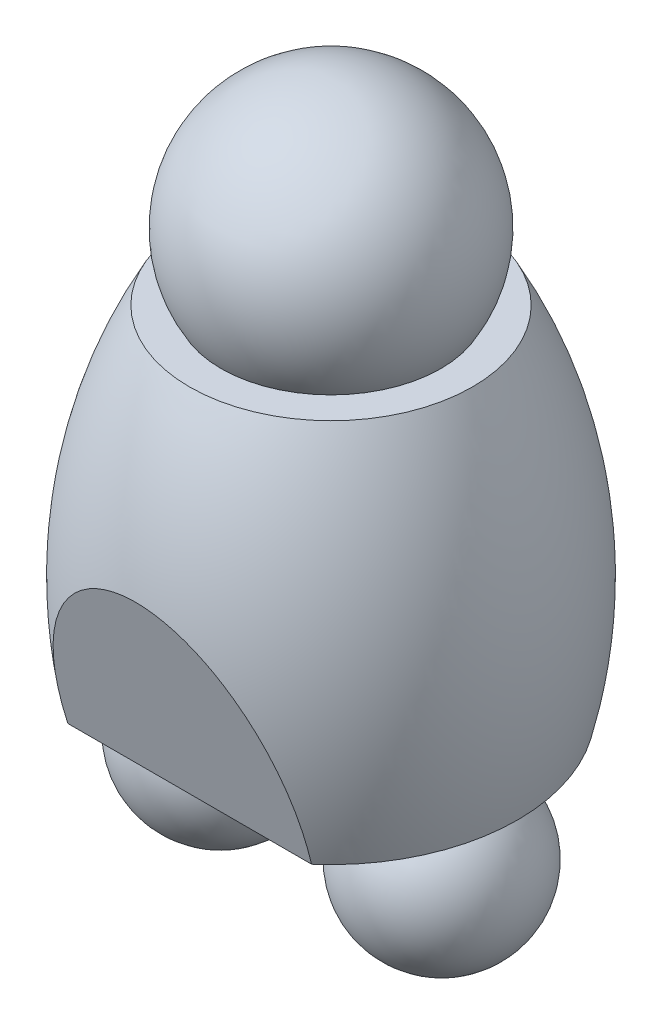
ISO-10303-21;
HEADER;
FILE_DESCRIPTION(('STEP AP214'),'2;1');
FILE_NAME('part.step','',(''),(''),'','','');
FILE_SCHEMA(('AUTOMOTIVE_DESIGN { 1 0 10303 214 1 1 1 1 }'));
ENDSEC;
DATA;
#1=APPLICATION_CONTEXT('core data for automotive mechanical design processes');
#2=APPLICATION_PROTOCOL_DEFINITION('international standard','automotive_design',2000,#1);
#3=PRODUCT_CONTEXT('',#1,'mechanical');
#4=PRODUCT('Part','Part','',(#3));
#5=PRODUCT_RELATED_PRODUCT_CATEGORY('part','',(#4));
#6=PRODUCT_DEFINITION_FORMATION('','',#4);
#7=PRODUCT_DEFINITION_CONTEXT('part definition',#1,'design');
#8=PRODUCT_DEFINITION('design','',#6,#7);
#9=PRODUCT_DEFINITION_SHAPE('','',#8);
#10=(LENGTH_UNIT() NAMED_UNIT(*) SI_UNIT(.MILLI.,.METRE.));
#11=(NAMED_UNIT(*) PLANE_ANGLE_UNIT() SI_UNIT($,.RADIAN.));
#12=(NAMED_UNIT(*) SI_UNIT($,.STERADIAN.) SOLID_ANGLE_UNIT());
#13=UNCERTAINTY_MEASURE_WITH_UNIT(LENGTH_MEASURE(1.E-05),#10,'distance_accuracy_value','');
#14=(GEOMETRIC_REPRESENTATION_CONTEXT(3) GLOBAL_UNCERTAINTY_ASSIGNED_CONTEXT((#13)) GLOBAL_UNIT_ASSIGNED_CONTEXT((#10,
#11,#12)) REPRESENTATION_CONTEXT('',''));
#15=CARTESIAN_POINT('',(0.,0.,0.));
#16=DIRECTION('',(0.,0.,1.));
#17=DIRECTION('',(1.,0.,0.));
#18=AXIS2_PLACEMENT_3D('',#15,#16,#17);
#19=CARTESIAN_POINT('',(-0.000695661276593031,100.35997198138,0.571810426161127));
#20=DIRECTION('',(0.,-1.,0.));
#21=DIRECTION('',(0.,0.,-1.));
#22=AXIS2_PLACEMENT_3D('',#19,#20,#21);
#23=PLANE('',#22);
#24=CARTESIAN_POINT('',(-0.000695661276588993,100.35997198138,0.571810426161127));
#25=DIRECTION('',(0.,-1.,0.));
#26=DIRECTION('',(0.,0.,-1.));
#27=AXIS2_PLACEMENT_3D('',#24,#25,#26);
#28=CIRCLE('',#27,65.0874690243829);
#29=CARTESIAN_POINT('',(-0.000695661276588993,100.35997198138,-64.5156585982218));
#30=VERTEX_POINT('',#29);
#31=EDGE_CURVE('E68',#30,#30,#28,.T.);
#32=ORIENTED_EDGE('',*,*,#31,.T.);
#33=EDGE_LOOP('',(#32));
#34=FACE_BOUND('',#33,.T.);
#35=CARTESIAN_POINT('',(-0.000695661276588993,100.35997198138,0.571810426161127));
#36=DIRECTION('',(0.,1.,0.));
#37=DIRECTION('',(0.,0.,1.));
#38=AXIS2_PLACEMENT_3D('',#35,#36,#37);
#39=CIRCLE('',#38,83.8200000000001);
#40=CARTESIAN_POINT('',(-0.000695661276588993,100.35997198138,84.3918104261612));
#41=VERTEX_POINT('',#40);
#42=EDGE_CURVE('E74',#41,#41,#39,.T.);
#43=ORIENTED_EDGE('',*,*,#42,.T.);
#44=EDGE_LOOP('',(#43));
#45=FACE_BOUND('',#44,.T.);
#46=ADVANCED_FACE('F32',(#34,#45),#23,.F.);
#47=CARTESIAN_POINT('',(-0.000695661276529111,-108.42802801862,0.571810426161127));
#48=DIRECTION('',(0.,1.,0.));
#49=DIRECTION('',(0.,0.,1.));
#50=AXIS2_PLACEMENT_3D('',#47,#48,#49);
#51=PLANE('',#50);
#52=CARTESIAN_POINT('',(-65.5326956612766,-108.42802801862,0.571810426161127));
#53=DIRECTION('',(0.,1.,0.));
#54=DIRECTION('',(0.,0.,1.));
#55=AXIS2_PLACEMENT_3D('',#52,#53,#54);
#56=CIRCLE('',#55,25.4448675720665);
#57=CARTESIAN_POINT('',(-65.5326956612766,-108.42802801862,26.0166779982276));
#58=VERTEX_POINT('',#57);
#59=EDGE_CURVE('E35',#58,#58,#56,.T.);
#60=ORIENTED_EDGE('',*,*,#59,.T.);
#61=EDGE_LOOP('',(#60));
#62=FACE_BOUND('',#61,.T.);
#63=CARTESIAN_POINT('',(65.5313043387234,-108.42802801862,0.571810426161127));
#64=DIRECTION('',(0.,1.,0.));
#65=DIRECTION('',(0.,0.,1.));
#66=AXIS2_PLACEMENT_3D('',#63,#64,#65);
#67=CIRCLE('',#66,25.4448675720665);
#68=CARTESIAN_POINT('',(65.5313043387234,-108.42802801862,26.0166779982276));
#69=VERTEX_POINT('',#68);
#70=EDGE_CURVE('E164',#69,#69,#67,.T.);
#71=ORIENTED_EDGE('',*,*,#70,.T.);
#72=EDGE_LOOP('',(#71));
#73=FACE_BOUND('',#72,.T.);
#74=CARTESIAN_POINT('',(-0.000695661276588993,-108.42802801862,0.571810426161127));
#75=DIRECTION('',(0.,1.,0.));
#76=DIRECTION('',(0.,0.,1.));
#77=AXIS2_PLACEMENT_3D('',#74,#75,#76);
#78=CIRCLE('',#77,110.49);
#79=CARTESIAN_POINT('',(72.1683763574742,-108.42802801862,84.2358119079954));
#80=VERTEX_POINT('',#79);
#81=CARTESIAN_POINT('',(71.1075015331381,-108.42802801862,-83.9957033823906));
#82=VERTEX_POINT('',#81);
#83=EDGE_CURVE('E67',#80,#82,#78,.T.);
#84=ORIENTED_EDGE('',*,*,#83,.F.);
#85=DIRECTION('',(1.,0.,0.));
#86=VECTOR('',#85,1.);
#87=CARTESIAN_POINT('',(-95.8619077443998,-108.42802801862,84.2358119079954));
#88=LINE('',#87,#86);
#89=CARTESIAN_POINT('',(-72.1697676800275,-108.42802801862,84.2358119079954));
#90=VERTEX_POINT('',#89);
#91=EDGE_CURVE('E47',#90,#80,#88,.T.);
#92=ORIENTED_EDGE('',*,*,#91,.F.);
#93=CARTESIAN_POINT('',(-71.1088928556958,-108.42802801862,-83.9957033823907));
#94=VERTEX_POINT('',#93);
#95=EDGE_CURVE('E66',#94,#90,#78,.T.);
#96=ORIENTED_EDGE('',*,*,#95,.F.);
#97=DIRECTION('',(1.,0.,0.));
#98=VECTOR('',#97,1.);
#99=CARTESIAN_POINT('',(-95.8619077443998,-108.42802801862,-83.9957033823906));
#100=LINE('',#99,#98);
#101=EDGE_CURVE('E53',#94,#82,#100,.T.);
#102=ORIENTED_EDGE('',*,*,#101,.T.);
#103=EDGE_LOOP('',(#84,#92,#96,#102));
#104=FACE_BOUND('',#103,.T.);
#105=ADVANCED_FACE('F65',(#62,#73,#104),#51,.F.);
#106=CARTESIAN_POINT('',(-0.000695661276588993,-38.2840543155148,0.571810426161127));
#107=DIRECTION('',(0.,1.,0.));
#108=DIRECTION('',(0.,0.,1.));
#109=AXIS2_PLACEMENT_3D('',#106,#107,#108);
#110=DEGENERATE_TOROIDAL_SURFACE('',#109,170.973777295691,290.072465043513,.F.);
#111=ORIENTED_EDGE('',*,*,#95,.T.);
#112=CARTESIAN_POINT('',(-72.1696999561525,-108.42922801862,84.2354753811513));
#113=CARTESIAN_POINT('',(-72.2949187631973,-106.209966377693,84.8578429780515));
#114=CARTESIAN_POINT('',(-72.3756419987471,-103.988332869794,85.4808757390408));
#115=CARTESIAN_POINT('',(-72.4461577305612,-99.5435416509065,86.7273687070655));
#116=CARTESIAN_POINT('',(-72.4359420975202,-97.3203838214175,87.3508289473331));
#117=CARTESIAN_POINT('',(-72.3225050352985,-92.8717544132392,88.5983982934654));
#118=CARTESIAN_POINT('',(-72.2190991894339,-90.6462869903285,89.2225062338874));
#119=CARTESIAN_POINT('',(-71.9168434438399,-86.2016132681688,90.468966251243));
#120=CARTESIAN_POINT('',(-71.7179942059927,-83.9824069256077,91.0913183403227));
#121=CARTESIAN_POINT('',(-70.9690883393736,-77.2907138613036,92.9679302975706));
#122=CARTESIAN_POINT('',(-70.2677695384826,-72.832345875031,94.218230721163));
#123=CARTESIAN_POINT('',(-68.89891737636,-66.2094785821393,96.0755412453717));
#124=CARTESIAN_POINT('',(-68.3900717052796,-64.0134501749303,96.6913933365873));
#125=CARTESIAN_POINT('',(-67.2630789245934,-59.6468985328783,97.9159448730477));
#126=CARTESIAN_POINT('',(-66.6449120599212,-57.4763799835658,98.5246430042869));
#127=CARTESIAN_POINT('',(-65.1187780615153,-52.6034942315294,99.89119039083));
#128=CARTESIAN_POINT('',(-64.1773155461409,-49.9107552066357,100.646339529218));
#129=CARTESIAN_POINT('',(-62.1063142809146,-44.5938590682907,102.137404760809));
#130=CARTESIAN_POINT('',(-60.9768272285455,-41.9696833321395,102.873326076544));
#131=CARTESIAN_POINT('',(-58.5234977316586,-36.8154447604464,104.318775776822));
#132=CARTESIAN_POINT('',(-57.2002413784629,-34.2851259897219,105.02837593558));
#133=CARTESIAN_POINT('',(-55.0607681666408,-30.5731062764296,106.06937116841));
#134=CARTESIAN_POINT('',(-54.3218733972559,-29.3497162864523,106.412457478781));
#135=CARTESIAN_POINT('',(-52.7910949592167,-26.93402866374,107.089910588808));
#136=CARTESIAN_POINT('',(-51.9992120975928,-25.741730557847,107.424277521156));
#137=CARTESIAN_POINT('',(-49.9753704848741,-22.8388004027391,108.238372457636));
#138=CARTESIAN_POINT('',(-48.7117623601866,-21.1484432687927,108.712414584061));
#139=CARTESIAN_POINT('',(-46.0631689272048,-17.8580698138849,109.635163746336));
#140=CARTESIAN_POINT('',(-44.678185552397,-16.2580520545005,110.083871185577));
#141=CARTESIAN_POINT('',(-41.7850953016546,-13.1672810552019,110.950644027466));
#142=CARTESIAN_POINT('',(-40.2771164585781,-11.6764171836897,111.368740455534));
#143=CARTESIAN_POINT('',(-37.1347728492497,-8.82251951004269,112.169084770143));
#144=CARTESIAN_POINT('',(-35.5003991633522,-7.45949474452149,112.551330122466));
#145=CARTESIAN_POINT('',(-32.5252933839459,-5.20319090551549,113.184085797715));
#146=CARTESIAN_POINT('',(-31.2114834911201,-4.27693864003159,113.443843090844));
#147=CARTESIAN_POINT('',(-28.5155762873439,-2.52282017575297,113.93576638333));
#148=CARTESIAN_POINT('',(-27.1335181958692,-1.6948983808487,114.167947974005));
#149=CARTESIAN_POINT('',(-24.3045471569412,-0.149304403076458,114.601392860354));
#150=CARTESIAN_POINT('',(-22.8576478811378,0.568390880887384,114.802662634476));
#151=CARTESIAN_POINT('',(-19.9048608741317,1.88121448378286,115.170829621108));
#152=CARTESIAN_POINT('',(-18.3989723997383,2.47634125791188,115.337726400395));
#153=CARTESIAN_POINT('',(-15.3215642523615,3.53716932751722,115.635224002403));
#154=CARTESIAN_POINT('',(-13.7495463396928,4.00154634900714,115.765453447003));
#155=CARTESIAN_POINT('',(-11.3625260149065,4.5869090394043,115.929611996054));
#156=CARTESIAN_POINT('',(-10.5618701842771,4.76351841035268,115.979140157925));
#157=CARTESIAN_POINT('',(-8.95254067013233,5.07861300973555,116.067504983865));
#158=CARTESIAN_POINT('',(-8.14386807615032,5.21710334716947,116.106343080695));
#159=CARTESIAN_POINT('',(-6.52088280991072,5.45496873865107,116.173049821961));
#160=CARTESIAN_POINT('',(-5.70657410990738,5.55436895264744,116.200925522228));
#161=CARTESIAN_POINT('',(-4.07388799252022,5.71350883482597,116.245554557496));
#162=CARTESIAN_POINT('',(-3.25551112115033,5.77325368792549,116.262309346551));
#163=CARTESIAN_POINT('',(-1.61668865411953,5.85268214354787,116.284584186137));
#164=CARTESIAN_POINT('',(-0.796243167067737,5.87236780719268,116.290104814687));
#165=CARTESIAN_POINT('',(0.844540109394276,5.87156387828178,116.289879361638));
#166=CARTESIAN_POINT('',(1.66487790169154,5.85107579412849,116.284133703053));
#167=CARTESIAN_POINT('',(3.88460021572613,5.74126831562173,116.253339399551));
#168=CARTESIAN_POINT('',(5.28212988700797,5.61344439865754,116.217492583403));
#169=CARTESIAN_POINT('',(8.06031760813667,5.24324081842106,116.113673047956));
#170=CARTESIAN_POINT('',(9.44097762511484,5.00087464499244,116.045704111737));
#171=CARTESIAN_POINT('',(12.1766638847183,4.40620264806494,115.87893486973));
#172=CARTESIAN_POINT('',(13.5316864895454,4.05388134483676,115.780130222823));
#173=CARTESIAN_POINT('',(16.2078873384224,3.24554824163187,115.553442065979));
#174=CARTESIAN_POINT('',(17.5290636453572,2.78953052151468,115.425556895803));
#175=CARTESIAN_POINT('',(20.1467583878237,1.77505486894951,115.141058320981));
#176=CARTESIAN_POINT('',(21.44278495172,1.21542404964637,114.984115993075));
#177=CARTESIAN_POINT('',(23.9882597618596,0.00569703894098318,114.64486131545));
#178=CARTESIAN_POINT('',(25.2377092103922,-0.644396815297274,114.462549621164));
#179=CARTESIAN_POINT('',(27.6867077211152,-2.02689924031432,114.074841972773));
#180=CARTESIAN_POINT('',(28.8862449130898,-2.75932724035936,113.869440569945));
#181=CARTESIAN_POINT('',(31.2330376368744,-4.2984740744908,113.437803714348));
#182=CARTESIAN_POINT('',(32.3802813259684,-5.10520961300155,113.211563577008));
#183=CARTESIAN_POINT('',(34.3827534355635,-6.60664205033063,112.790503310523));
#184=CARTESIAN_POINT('',(35.2482379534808,-7.28872754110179,112.599219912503));
#185=CARTESIAN_POINT('',(36.9453482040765,-8.69053124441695,112.206099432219));
#186=CARTESIAN_POINT('',(37.7769792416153,-9.41024352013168,112.004264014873));
#187=CARTESIAN_POINT('',(40.2219605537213,-11.6217986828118,111.384057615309));
#188=CARTESIAN_POINT('',(41.7849368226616,-13.1657100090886,110.951084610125));
#189=CARTESIAN_POINT('',(44.7799055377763,-16.3712042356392,110.052138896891));
#190=CARTESIAN_POINT('',(46.2116531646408,-18.032997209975,109.586107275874));
#191=CARTESIAN_POINT('',(48.944956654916,-21.452836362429,108.627050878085));
#192=CARTESIAN_POINT('',(50.2465137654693,-23.2108816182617,108.134026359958));
#193=CARTESIAN_POINT('',(52.3780764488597,-26.3052922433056,107.266232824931));
#194=CARTESIAN_POINT('',(53.2383534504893,-27.6225089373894,106.896833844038));
#195=CARTESIAN_POINT('',(54.8953204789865,-30.2936790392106,106.14773347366));
#196=CARTESIAN_POINT('',(55.6920047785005,-31.6476357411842,105.768031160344));
#197=CARTESIAN_POINT('',(57.2236745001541,-34.3880918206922,104.999500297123));
#198=CARTESIAN_POINT('',(57.9586378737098,-35.7746026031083,104.610668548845));
#199=CARTESIAN_POINT('',(59.3682010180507,-38.5756235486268,103.825152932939));
#200=CARTESIAN_POINT('',(60.042802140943,-39.9901330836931,103.428469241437));
#201=CARTESIAN_POINT('',(61.9826477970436,-44.2794015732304,102.225590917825));
#202=CARTESIAN_POINT('',(63.159375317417,-47.191666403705,101.408878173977));
#203=CARTESIAN_POINT('',(65.2886590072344,-53.0901739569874,99.754706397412));
#204=CARTESIAN_POINT('',(66.2412354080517,-56.0764099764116,98.9172492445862));
#205=CARTESIAN_POINT('',(67.6525421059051,-61.1041843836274,97.5072650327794));
#206=CARTESIAN_POINT('',(68.1702815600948,-63.1305751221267,96.938985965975));
#207=CARTESIAN_POINT('',(69.1133986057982,-67.2031819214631,95.7968680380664));
#208=CARTESIAN_POINT('',(69.5387701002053,-69.2493992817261,95.2230288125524));
#209=CARTESIAN_POINT('',(70.6806447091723,-75.4134483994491,93.4943888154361));
#210=CARTESIAN_POINT('',(71.262522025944,-79.5552833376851,92.3328566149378));
#211=CARTESIAN_POINT('',(71.8768015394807,-85.7656889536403,90.5912164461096));
#212=CARTESIAN_POINT('',(72.0382705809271,-87.8236275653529,90.0140901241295));
#213=CARTESIAN_POINT('',(72.2796980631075,-91.9441576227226,88.8585326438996));
#214=CARTESIAN_POINT('',(72.3596545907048,-94.0067491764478,88.2801014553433));
#215=CARTESIAN_POINT('',(72.4397018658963,-98.1304287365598,87.1236607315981));
#216=CARTESIAN_POINT('',(72.439903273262,-100.191514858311,86.5456517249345));
#217=CARTESIAN_POINT('',(72.3622532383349,-104.312154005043,85.3900636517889));
#218=CARTESIAN_POINT('',(72.2844085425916,-106.37170714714,84.812484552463));
#219=CARTESIAN_POINT('',(72.1683086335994,-108.42922801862,84.2354753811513));
#220=B_SPLINE_CURVE_WITH_KNOTS('',3,(#112,#113,#114,#115,#116,#117,#118,#119,#120,#121,#122,
#123,#124,#125,#126,#127,#128,#129,#130,#131,#132,#133,#134,#135,#136,#137,#138,#139,#140,#141,
#142,#143,#144,#145,#146,#147,#148,#149,#150,#151,#152,#153,#154,#155,#156,#157,#158,#159,#160,
#161,#162,#163,#164,#165,#166,#167,#168,#169,#170,#171,#172,#173,#174,#175,#176,#177,#178,#179,
#180,#181,#182,#183,#184,#185,#186,#187,#188,#189,#190,#191,#192,#193,#194,#195,#196,#197,#198,
#199,#200,#201,#202,#203,#204,#205,#206,#207,#208,#209,#210,#211,#212,#213,#214,#215,#216,#217,
#218,#219),.UNSPECIFIED.,.F.,.F.,(4,2,2,2,2,2,2,2,2,2,2,2,2,2,2,2,2,2,2,2,2,2,2,2,2,2,2,2,2,2,2,
2,2,2,2,2,2,2,2,2,2,2,2,2,2,2,2,2,2,2,2,2,2,4),(0.,6.92445185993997,13.8495227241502,
20.7883279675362,27.7270850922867,41.7543503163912,48.7627166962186,55.7723508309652,
64.6182711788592,73.4617633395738,82.2790390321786,86.6873771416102,91.0956481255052,
97.5795556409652,104.063359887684,110.540498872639,117.018095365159,121.899006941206,
126.777145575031,131.654260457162,136.531436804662,141.456366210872,143.919738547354,
146.382780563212,148.84423466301,151.305366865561,153.76637243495,156.227285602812,
160.433115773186,164.638450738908,168.844378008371,173.050545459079,177.307613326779,
181.564571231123,185.822535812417,190.081459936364,193.435538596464,196.789089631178,
203.497949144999,210.219080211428,216.94014688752,221.78664462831,226.633578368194,
231.482236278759,236.330785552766,246.056872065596,255.782080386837,262.281966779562,
268.782282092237,281.787393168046,288.216557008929,294.645871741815,301.066265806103,
307.486104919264),.UNSPECIFIED.);
#221=EDGE_CURVE('E11',#90,#80,#220,.T.);
#222=ORIENTED_EDGE('',*,*,#221,.T.);
#223=ORIENTED_EDGE('',*,*,#83,.T.);
#224=CARTESIAN_POINT('',(71.1076192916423,-108.42922801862,-83.9952136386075));
#225=CARTESIAN_POINT('',(70.9382420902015,-106.703402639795,-84.6995571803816));
#226=CARTESIAN_POINT('',(70.735817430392,-104.980302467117,-85.4027885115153));
#227=CARTESIAN_POINT('',(70.263025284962,-101.541922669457,-86.8060594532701));
#228=CARTESIAN_POINT('',(69.9926500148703,-99.8266439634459,-87.5060986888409));
#229=CARTESIAN_POINT('',(69.3815035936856,-96.4030712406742,-88.9033265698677));
#230=CARTESIAN_POINT('',(69.0405853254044,-94.6947995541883,-89.600506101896));
#231=CARTESIAN_POINT('',(68.2867993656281,-91.292108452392,-90.9892117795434));
#232=CARTESIAN_POINT('',(67.8739326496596,-89.5976888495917,-91.6807380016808));
#233=CARTESIAN_POINT('',(66.5138004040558,-84.5007724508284,-93.760890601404));
#234=CARTESIAN_POINT('',(65.4517725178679,-81.1233253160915,-95.1392937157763));
#235=CARTESIAN_POINT('',(63.6183836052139,-76.135944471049,-97.1747426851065));
#236=CARTESIAN_POINT('',(62.9674958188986,-74.4872415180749,-97.8476110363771));
#237=CARTESIAN_POINT('',(61.582660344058,-71.2194811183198,-99.1812488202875));
#238=CARTESIAN_POINT('',(60.8486970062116,-69.6004293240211,-99.8420159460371));
#239=CARTESIAN_POINT('',(59.0662071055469,-65.9257511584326,-101.341724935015));
#240=CARTESIAN_POINT('',(57.9887210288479,-63.8820732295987,-102.175790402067));
#241=CARTESIAN_POINT('',(55.6847057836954,-59.8685098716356,-103.813805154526));
#242=CARTESIAN_POINT('',(54.4582177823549,-57.8986042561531,-104.617762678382));
#243=CARTESIAN_POINT('',(51.8542667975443,-54.0545529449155,-106.18659620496));
#244=CARTESIAN_POINT('',(50.4772918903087,-52.1801249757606,-106.951587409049));
#245=CARTESIAN_POINT('',(47.5642325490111,-48.5403629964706,-108.437046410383));
#246=CARTESIAN_POINT('',(46.0281876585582,-46.775002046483,-109.157525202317));
#247=CARTESIAN_POINT('',(43.1509302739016,-43.7525550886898,-110.391045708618));
#248=CARTESIAN_POINT('',(41.841675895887,-42.4693590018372,-110.914743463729));
#249=CARTESIAN_POINT('',(39.1236174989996,-39.9963858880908,-111.924012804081));
#250=CARTESIAN_POINT('',(37.7148171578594,-38.8066054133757,-112.409585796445));
#251=CARTESIAN_POINT('',(34.7994710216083,-36.5359087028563,-113.33630212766));
#252=CARTESIAN_POINT('',(33.2929845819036,-35.4549273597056,-113.777472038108));
#253=CARTESIAN_POINT('',(30.1847358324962,-33.4173961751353,-114.609028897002));
#254=CARTESIAN_POINT('',(28.5829935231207,-32.4608203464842,-114.999426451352));
#255=CARTESIAN_POINT('',(25.6088169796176,-30.8606423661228,-115.652490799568));
#256=CARTESIAN_POINT('',(24.2518940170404,-30.1922829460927,-115.925261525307));
#257=CARTESIAN_POINT('',(21.4851430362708,-28.9570054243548,-116.429402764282));
#258=CARTESIAN_POINT('',(20.0753209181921,-28.3900760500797,-116.660777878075));
#259=CARTESIAN_POINT('',(17.2103287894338,-27.366827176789,-117.078386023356));
#260=CARTESIAN_POINT('',(15.7551837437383,-26.9104479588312,-117.264643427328));
#261=CARTESIAN_POINT('',(12.8075480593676,-26.1159183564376,-117.588906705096));
#262=CARTESIAN_POINT('',(11.3150569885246,-25.7777693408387,-117.726912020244));
#263=CARTESIAN_POINT('',(8.29537517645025,-25.2247696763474,-117.952602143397));
#264=CARTESIAN_POINT('',(6.76804309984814,-25.0105776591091,-118.040018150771));
#265=CARTESIAN_POINT('',(3.69853826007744,-24.7127098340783,-118.161583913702));
#266=CARTESIAN_POINT('',(2.15636548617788,-24.6290341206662,-118.195733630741));
#267=CARTESIAN_POINT('',(-0.929533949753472,-24.5939955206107,-118.210033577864));
#268=CARTESIAN_POINT('',(-2.47326038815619,-24.6426157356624,-118.190190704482));
#269=CARTESIAN_POINT('',(-5.54926322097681,-24.8710931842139,-118.096944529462));
#270=CARTESIAN_POINT('',(-7.08154009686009,-25.0509448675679,-118.023543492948));
#271=CARTESIAN_POINT('',(-9.99777444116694,-25.5181406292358,-117.832871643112));
#272=CARTESIAN_POINT('',(-11.3836175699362,-25.7954963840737,-117.719677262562));
#273=CARTESIAN_POINT('',(-14.1263769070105,-26.4529483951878,-117.451358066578));
#274=CARTESIAN_POINT('',(-15.4832956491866,-26.8330356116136,-117.296236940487));
#275=CARTESIAN_POINT('',(-18.1612364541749,-27.6901847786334,-116.946417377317));
#276=CARTESIAN_POINT('',(-19.48224835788,-28.167273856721,-116.751707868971));
#277=CARTESIAN_POINT('',(-22.0820279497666,-29.2116352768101,-116.325483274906));
#278=CARTESIAN_POINT('',(-23.3607893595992,-29.7789209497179,-116.093962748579));
#279=CARTESIAN_POINT('',(-26.2748465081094,-31.1922842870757,-115.517141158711));
#280=CARTESIAN_POINT('',(-27.8926661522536,-32.069371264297,-115.159184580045));
#281=CARTESIAN_POINT('',(-31.0386735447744,-33.9518747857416,-114.390897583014));
#282=CARTESIAN_POINT('',(-32.5668379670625,-34.9573245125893,-113.980553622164));
#283=CARTESIAN_POINT('',(-35.5304317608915,-37.0813923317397,-113.113679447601));
#284=CARTESIAN_POINT('',(-36.9657742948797,-38.2001139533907,-112.65710698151));
#285=CARTESIAN_POINT('',(-39.740307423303,-40.535096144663,-111.704154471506));
#286=CARTESIAN_POINT('',(-41.0794931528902,-41.7513616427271,-111.207772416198));
#287=CARTESIAN_POINT('',(-44.1337017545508,-44.728297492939,-109.992825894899));
#288=CARTESIAN_POINT('',(-45.8072721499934,-46.5255130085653,-109.259346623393));
#289=CARTESIAN_POINT('',(-48.9785615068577,-50.248376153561,-107.739972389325));
#290=CARTESIAN_POINT('',(-50.4762165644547,-52.1740700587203,-106.954058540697));
#291=CARTESIAN_POINT('',(-53.306561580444,-56.1375973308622,-105.336464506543));
#292=CARTESIAN_POINT('',(-54.6385521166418,-58.1758569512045,-104.504610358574));
#293=CARTESIAN_POINT('',(-57.1373467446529,-62.3379311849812,-102.805985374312));
#294=CARTESIAN_POINT('',(-58.3040969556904,-64.4617734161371,-101.939203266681));
#295=CARTESIAN_POINT('',(-60.2231681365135,-68.270666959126,-100.384718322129));
#296=CARTESIAN_POINT('',(-61.0084591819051,-69.9415992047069,-99.7027777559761));
#297=CARTESIAN_POINT('',(-62.4888252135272,-73.3167505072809,-98.3253116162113));
#298=CARTESIAN_POINT('',(-63.1839201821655,-75.0209620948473,-97.6297890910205));
#299=CARTESIAN_POINT('',(-65.1400563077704,-80.1798886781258,-95.5243289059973));
#300=CARTESIAN_POINT('',(-66.2704899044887,-83.6779602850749,-94.0966965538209));
#301=CARTESIAN_POINT('',(-67.7128824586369,-88.9551669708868,-91.9429639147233));
#302=CARTESIAN_POINT('',(-68.1492162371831,-90.7065434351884,-91.2281924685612));
#303=CARTESIAN_POINT('',(-68.9446301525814,-94.2244814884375,-89.7924522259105));
#304=CARTESIAN_POINT('',(-69.3037092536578,-95.9910432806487,-89.0714833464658));
#305=CARTESIAN_POINT('',(-69.9459610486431,-99.5315215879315,-87.6265439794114));
#306=CARTESIAN_POINT('',(-70.2293128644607,-101.305410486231,-86.9025847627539));
#307=CARTESIAN_POINT('',(-70.7232268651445,-104.861639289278,-85.451217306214));
#308=CARTESIAN_POINT('',(-70.9337982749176,-106.64397809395,-84.7238095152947));
#309=CARTESIAN_POINT('',(-71.1090106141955,-108.42922801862,-83.9952136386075));
#310=B_SPLINE_CURVE_WITH_KNOTS('',3,(#224,#225,#226,#227,#228,#229,#230,#231,#232,#233,#234,
#235,#236,#237,#238,#239,#240,#241,#242,#243,#244,#245,#246,#247,#248,#249,#250,#251,#252,#253,
#254,#255,#256,#257,#258,#259,#260,#261,#262,#263,#264,#265,#266,#267,#268,#269,#270,#271,#272,
#273,#274,#275,#276,#277,#278,#279,#280,#281,#282,#283,#284,#285,#286,#287,#288,#289,#290,#291,
#292,#293,#294,#295,#296,#297,#298,#299,#300,#301,#302,#303,#304,#305,#306,#307,#308,#309),
.UNSPECIFIED.,.F.,.F.,(4,2,2,2,2,2,2,2,2,2,2,2,2,2,2,2,2,2,2,2,2,2,2,2,2,2,2,2,2,2,2,2,2,2,2,2,
2,2,2,2,2,2,4),(0.,5.61488076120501,11.2304050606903,16.8577607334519,22.4850401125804,
33.8663161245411,39.5525345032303,45.2398258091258,52.6031114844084,59.9643673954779,
67.3024198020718,74.638652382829,80.3536668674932,86.0684703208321,91.7798333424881,
97.4900013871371,102.096575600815,106.702637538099,111.306205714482,115.909827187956,
120.53769007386,125.165556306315,129.792831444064,134.419910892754,138.668765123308,
142.917245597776,147.166915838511,151.417214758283,157.033311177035,162.650862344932,
168.273595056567,173.896612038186,181.574084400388,189.254337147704,196.965987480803,
204.680146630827,210.582226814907,216.482997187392,228.294965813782,234.117726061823,
239.940564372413,245.749505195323,251.55770946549),.UNSPECIFIED.);
#311=EDGE_CURVE('E40',#82,#94,#310,.T.);
#312=ORIENTED_EDGE('',*,*,#311,.T.);
#313=EDGE_LOOP('',(#111,#222,#223,#312));
#314=FACE_BOUND('',#313,.T.);
#315=ORIENTED_EDGE('',*,*,#42,.F.);
#316=EDGE_LOOP('',(#315));
#317=FACE_BOUND('',#316,.T.);
#318=ADVANCED_FACE('F70',(#314,#317),#110,.F.);
#319=CARTESIAN_POINT('',(-95.8619077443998,-24.60802801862,-118.204306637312));
#320=DIRECTION('',(0.,0.377862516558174,0.925861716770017));
#321=DIRECTION('',(0.,-0.925861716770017,0.377862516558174));
#322=AXIS2_PLACEMENT_3D('',#319,#320,#321);
#323=PLANE('',#322);
#324=ORIENTED_EDGE('',*,*,#101,.F.);
#325=ORIENTED_EDGE('',*,*,#311,.F.);
#326=EDGE_LOOP('',(#324,#325));
#327=FACE_BOUND('',#326,.T.);
#328=ADVANCED_FACE('F88',(#327),#323,.F.);
#329=CARTESIAN_POINT('',(-95.8619077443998,-108.42802801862,84.2358119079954));
#330=DIRECTION('',(0.,0.270021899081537,-0.962854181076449));
#331=DIRECTION('',(0.,0.962854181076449,0.270021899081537));
#332=AXIS2_PLACEMENT_3D('',#329,#330,#331);
#333=PLANE('',#332);
#334=ORIENTED_EDGE('',*,*,#91,.T.);
#335=ORIENTED_EDGE('',*,*,#221,.F.);
#336=EDGE_LOOP('',(#334,#335));
#337=FACE_BOUND('',#336,.T.);
#338=ADVANCED_FACE('F59',(#337),#333,.F.);
#339=CARTESIAN_POINT('',(-0.000695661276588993,139.98397198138,0.571810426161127));
#340=DIRECTION('',(0.,-1.,0.));
#341=DIRECTION('',(-1.,0.,0.));
#342=AXIS2_PLACEMENT_3D('',#339,#340,#341);
#343=SPHERICAL_SURFACE('',#342,76.2);
#344=ORIENTED_EDGE('',*,*,#31,.F.);
#345=EDGE_LOOP('',(#344));
#346=FACE_BOUND('',#345,.T.);
#347=ADVANCED_FACE('F94',(#346),#343,.T.);
#348=CARTESIAN_POINT('',(65.5313043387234,-151.10002801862,0.571810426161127));
#349=DIRECTION('',(0.,-1.,0.));
#350=DIRECTION('',(-1.,0.,0.));
#351=AXIS2_PLACEMENT_3D('',#348,#349,#350);
#352=SPHERICAL_SURFACE('',#351,49.6824);
#353=ORIENTED_EDGE('',*,*,#70,.F.);
#354=EDGE_LOOP('',(#353));
#355=FACE_BOUND('',#354,.T.);
#356=ADVANCED_FACE('F97',(#355),#352,.T.);
#357=CARTESIAN_POINT('',(-65.5326956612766,-151.10002801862,0.571810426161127));
#358=DIRECTION('',(0.,-1.,0.));
#359=DIRECTION('',(1.,0.,0.));
#360=AXIS2_PLACEMENT_3D('',#357,#358,#359);
#361=SPHERICAL_SURFACE('',#360,49.6824);
#362=ORIENTED_EDGE('',*,*,#59,.F.);
#363=EDGE_LOOP('',(#362));
#364=FACE_BOUND('',#363,.T.);
#365=ADVANCED_FACE('F101',(#364),#361,.T.);
#366=CLOSED_SHELL('',(#46,#105,#318,#328,#338,#347,#356,#365));
#367=MANIFOLD_SOLID_BREP('B2',#366);
#368=ADVANCED_BREP_SHAPE_REPRESENTATION('',(#18,#367),#14);
#369=SHAPE_DEFINITION_REPRESENTATION(#9,#368);
ENDSEC;
END-ISO-10303-21;
